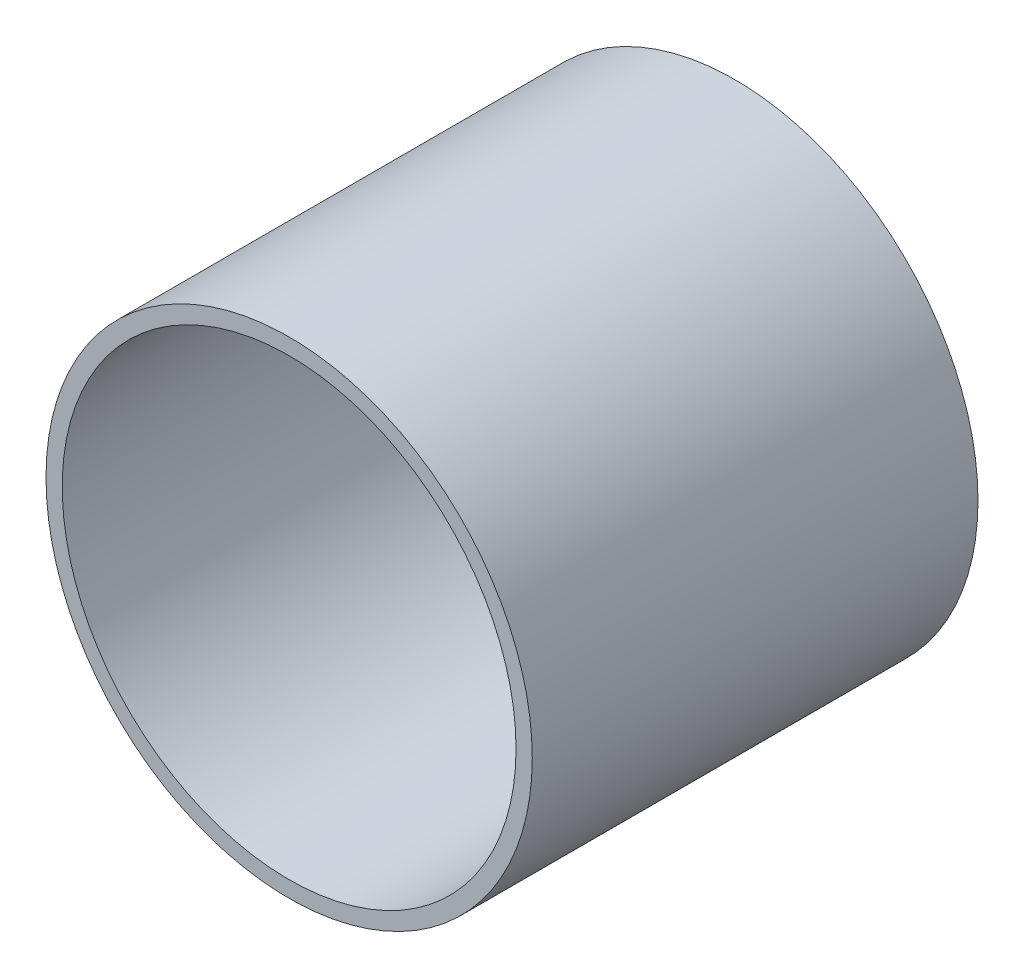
from build123d import *

# Parameters (mm, degrees)
ESQUISSE1_R   = 3
ESQUISSE1_R_2 = 2.8
BUSHING_DEPTH = 5.5


with BuildPart() as part:
    # Esquisse1 → Bushing (new body)
    with BuildSketch(Plane.XY):
        Circle(ESQUISSE1_R)
        Circle(ESQUISSE1_R_2, mode=Mode.SUBTRACT)
    extrude(amount=BUSHING_DEPTH)


solid = part.part
